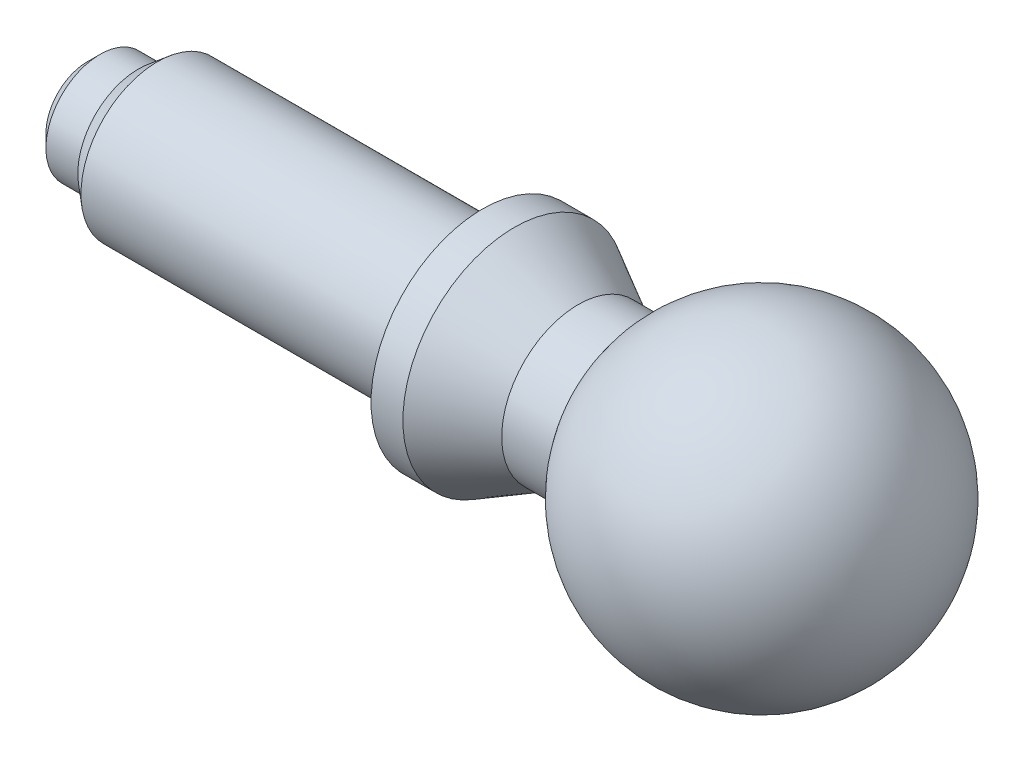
from build123d import *


with BuildPart() as part:
    # Esquisse1 → Base-R_volution (revolve)
    with BuildSketch(Plane.XY, mode=Mode.PRIVATE) as base_r_volution_sk:
        with BuildLine():
            Line((0, 0), (0, 6.5))
            Line((0, 6.5), (2, 8.5))
            Line((2, 8.5), (8, 8.5))
            Line((8, 8.5), (8, 9.5))
            Line((8, 9.5), (11, 12))
            Line((11, 12), (62, 12))
            Line((62, 12), (62, 17.5))
            Line((62, 17.5), (67, 17.5))
            Line((67, 17.5), (77, 12))
            Line((77, 12), (85, 12))
            ThreePointArc((85, 12), (111.996266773, 23.182219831), (129.784609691, 0))
            Line((129.784609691, 0), (0, 0))
        make_face()
    revolve(base_r_volution_sk.sketch.rotate(Axis((134.439404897, 0, 0), (-1, 0, 0)), 90), axis=Axis((134.439404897, 0, 0), (-1, 0, 0)))


solid = part.part
